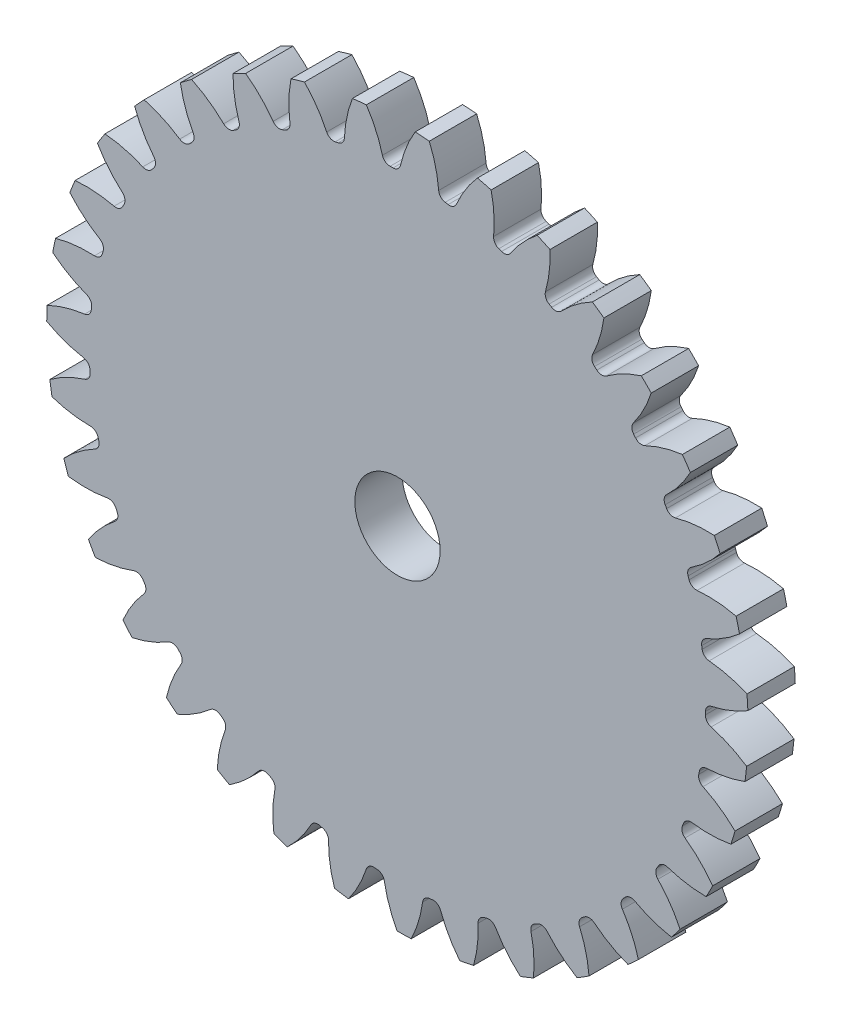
from build123d import *

# Parameters (mm, degrees)
SKETCH3_R         = 939.8
GEARBODY_DEPTH    = 127
TOOTHCUT_DEPTH    = 1336.131858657
CIRPATTERN1_COUNT = 35
BOREDIA_R         = 114.3
BORE_DEPTH        = 12700


with BuildPart() as part:
    # Sketch3 → gearBody (new body)
    with BuildSketch(Plane.XY):
        Circle(SKETCH3_R)
    extrude(amount=GEARBODY_DEPTH)

    # Sketch2 → toothCut (cut, through all)
    with BuildSketch(Plane.XY):
        with BuildLine():
            ThreePointArc((825.112408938, -25.293529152), (825.225873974, -21.272210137), (825.319740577, -17.250385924))
            ThreePointArc((825.319740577, -17.250385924), (830.013457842, -4.55978388), (841.550001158, 2.510614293))
            ThreePointArc((841.550001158, 2.510614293), (892.284251, 18.109172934), (939.8, 41.763617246))
            ThreePointArc((939.8, 41.763617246), (940.415115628, -24.241493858), (936.400191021, -90.127254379))
            ThreePointArc((936.400191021, -90.127254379), (890.166238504, -64.056182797), (840.303015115, -45.864478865))
            ThreePointArc((840.303015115, -45.864478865), (829.146064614, -38.209100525), (825.112408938, -25.293529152))
        make_face()
    toothcut = extrude(amount=TOOTHCUT_DEPTH, mode=Mode.SUBTRACT)

    # CirPattern1: toothCut ×35 about axis
    cirpattern1_axis = Axis((0, 0, 0), (0, 0, 1))
    for i in range(1, CIRPATTERN1_COUNT):
        add(toothcut.rotate(cirpattern1_axis, i * 360 / CIRPATTERN1_COUNT), mode=Mode.SUBTRACT)

    # boreDia → bore (cut, symmetric)
    with BuildSketch(Plane.XY):
        Circle(BOREDIA_R)
    extrude(amount=BORE_DEPTH, both=True, mode=Mode.SUBTRACT)


solid = part.part
